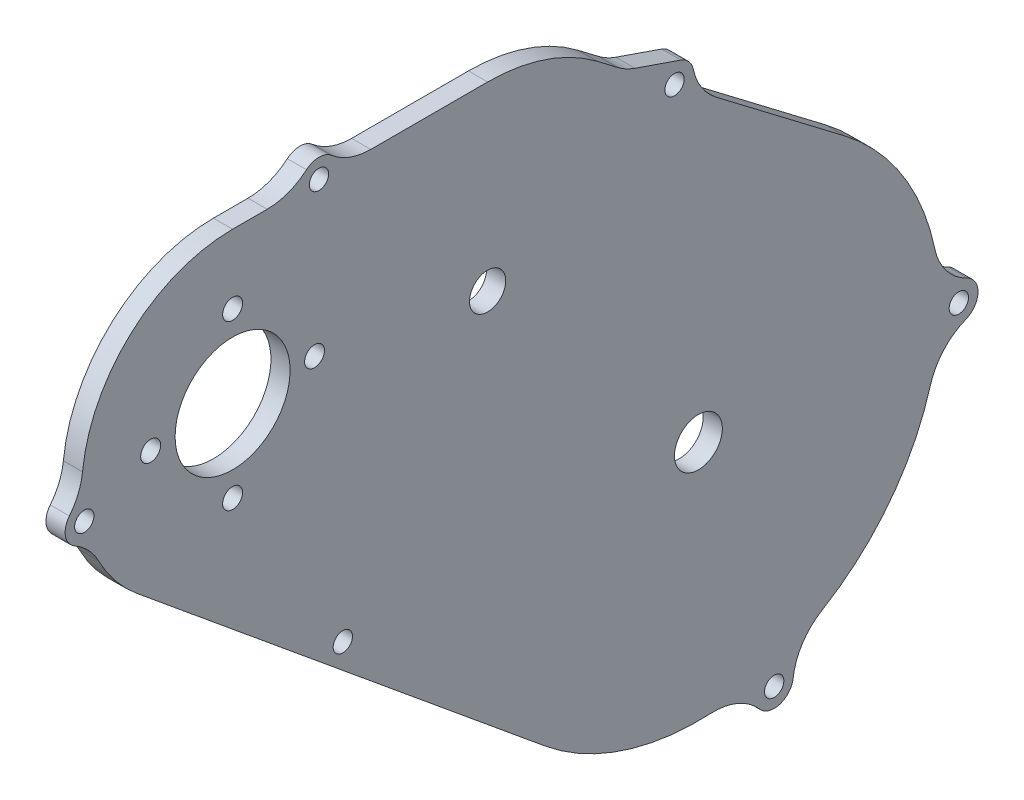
from build123d import *
from build123d.topology import SkipClean

# Parameters (mm, degrees)
SKETCH1_R           = 7.5
SKETCH1_R_2         = 6
SKETCH1_R_3         = 7.9375
BOSS_EXTRUDE1_DEPTH = 6.35
SKETCH2_R           = 3.2
BOSS_EXTRUDE2_DEPTH = 6.35
SKETCH2_4_R         = 3.2
CUT_EXTRUDE1_DEPTH  = 6.35
FILLET1_R           = 20
SKETCH4_R           = 3.302
SKETCH4_R_2         = 19.05
CUT_EXTRUDE2_DEPTH  = 431.293007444


with BuildPart() as part:
    # Sketch1 → Boss-Extrude1 (new body)
    with BuildSketch(Plane(origin=(0, 0, 0), x_dir=(0, 0, -1), z_dir=(1, 0, 0))):
        with BuildLine():
            Line((163.770527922, 94.777939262), (28.507823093, 206.208817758))
            ThreePointArc((28.507823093, 206.208817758), (13.238211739, 261.688470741), (60.299656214, 294.8))
            Line((60.299656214, 294.8), (144.8, 294.8))
            ThreePointArc((144.8, 294.8), (163.972250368, 291.654417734), (181.13423771, 282.547493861))
            Line((181.13423771, 282.547493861), (263.083111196, 220.187155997))
            ThreePointArc((263.083111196, 220.187155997), (277.353755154, 106.858285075), (163.770527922, 94.777939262))
        make_face()
        with Locations((60.299656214, 244.8)):
            Circle(SKETCH1_R, mode=Mode.SUBTRACT)
        with Locations((144.8, 234.8)):
            Circle(SKETCH1_R_2, mode=Mode.SUBTRACT)
        with Locations((214.637460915, 156.523830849)):
            Circle(SKETCH1_R_3, mode=Mode.SUBTRACT)
    extrude(amount=BOSS_EXTRUDE1_DEPTH)

    # Sketch2 → Boss-Extrude2 (add)
    # profile 1 of 5: a face of its own
    with BuildSketch(Plane.ZY):
        with BuildLine():
            ThreePointArc((-294.068401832, 146.998830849), (-294.574031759, 153.338765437), (-294.57443218, 159.698830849))
            Line((-294.57443218, 159.698830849), (-300.929070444, 159.698830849))
            ThreePointArc((-300.929070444, 159.698830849), (-307.279070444, 153.348830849), (-300.929070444, 146.998830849))
            Line((-300.929070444, 146.998830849), (-294.068401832, 146.998830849))
        make_face()
        with Locations((-300.929070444, 153.348830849)):
            Circle(SKETCH2_R, mode=Mode.SUBTRACT)
    # profile 2 of 5: a face of its own
    with BuildSketch(Plane.ZY):
        with BuildLine():
            ThreePointArc((-232.201821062, 78.475811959), (-237.893753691, 79.978779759), (-243.459749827, 81.896251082))
            Line((-243.459749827, 81.896251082), (-245.663286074, 76.190785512))
            ThreePointArc((-245.663286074, 76.190785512), (-241.585690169, 67.827252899), (-233.544660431, 72.508845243))
            Line((-233.544660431, 72.508845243), (-232.201821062, 78.475811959))
        make_face()
        with Locations((-239.73972193, 73.903016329)):
            Circle(SKETCH2_R, mode=Mode.SUBTRACT)
    # profile 3 of 5: a face of its own
    with BuildSketch(Plane.ZY):
        with BuildLine():
            Line((-212.944199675, 261.808035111), (-212.332558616, 258.806620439))
            Line((-212.332558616, 258.806620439), (-209.268614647, 261.1381788))
            ThreePointArc((-209.268614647, 261.1381788), (-208.659907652, 265.622537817), (-204.175548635, 265.013830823))
            Line((-204.175548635, 265.013830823), (-190.559908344, 275.37487537))
            Line((-190.559908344, 275.37487537), (-208.794705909, 269.078231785))
            ThreePointArc((-208.794705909, 269.078231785), (-212.23702746, 266.223682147), (-212.944199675, 261.808035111))
        make_face()
    # profile 4 of 5: a face of its own
    with BuildSketch(Plane.ZY):
        with BuildLine():
            ThreePointArc((-92.118800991, 294.8), (-88.918800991, 298), (-85.718800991, 294.8))
            Line((-85.718800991, 294.8), (-82.568800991, 294.8))
            ThreePointArc((-82.568800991, 294.8), (-88.918800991, 301.15), (-95.268800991, 294.8))
            Line((-95.268800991, 294.8), (-92.118800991, 294.8))
        make_face()
    # profile 5 of 5: a face of its own
    with BuildSketch(Plane.ZY):
        with BuildLine():
            ThreePointArc((-12.728672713, 229.405146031), (-4.920512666, 234.384964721), (-10.38609944, 241.861148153))
            ThreePointArc((-10.38609944, 241.861148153), (-10.503587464, 240.288732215), (-10.67059858, 238.720802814))
            ThreePointArc((-10.67059858, 238.720802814), (-8.731125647, 237.640730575), (-7.961108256, 235.558619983))
            ThreePointArc((-7.961108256, 235.558619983), (-9.157823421, 233.063254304), (-11.852889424, 232.434289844))
            ThreePointArc((-11.852889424, 232.434289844), (-12.266896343, 230.912812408), (-12.728672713, 229.405146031))
        make_face()
    extrude(amount=-BOSS_EXTRUDE2_DEPTH)

    # Sketch2_4 → Cut-Extrude1 (cut)
    with SkipClean():  # the faces are left unmerged after this step: merging them gives an invalid solid
        with BuildSketch(Plane.ZY):
            with Locations((-96.824907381, 158.155733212)):
                Circle(SKETCH2_4_R)
            with BuildLine():
                ThreePointArc((-10.67059858, 238.720802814), (-11.161108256, 235.558619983), (-11.852889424, 232.434289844))
                ThreePointArc((-11.852889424, 232.434289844), (-9.157823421, 233.063254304), (-7.961108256, 235.558619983))
                ThreePointArc((-7.961108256, 235.558619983), (-8.731125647, 237.640730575), (-10.67059858, 238.720802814))
            make_face()
            with BuildLine():
                ThreePointArc((-10.67059858, 238.720802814), (-14.305975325, 236.150068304), (-11.852889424, 232.434289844))
                ThreePointArc((-11.852889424, 232.434289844), (-11.161108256, 235.558619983), (-10.67059858, 238.720802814))
            make_face()
            with BuildLine():
                ThreePointArc((-92.118800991, 294.8), (-88.918800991, 291.6), (-85.718800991, 294.8))
                Line((-85.718800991, 294.8), (-92.118800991, 294.8))
            make_face()
            with BuildLine():
                Line((-92.118800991, 294.8), (-85.718800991, 294.8))
                ThreePointArc((-85.718800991, 294.8), (-88.918800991, 298), (-92.118800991, 294.8))
            make_face()
            with BuildLine():
                ThreePointArc((-204.175548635, 265.013830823), (-208.659907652, 265.622537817), (-209.268614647, 261.1381788))
                Line((-209.268614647, 261.1381788), (-204.175548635, 265.013830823))
            make_face()
            with BuildLine():
                Line((-204.175548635, 265.013830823), (-209.268614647, 261.1381788))
                ThreePointArc((-209.268614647, 261.1381788), (-205.699561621, 260.043769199), (-203.522081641, 263.076004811))
                ThreePointArc((-203.522081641, 263.076004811), (-203.689846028, 264.098524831), (-204.175548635, 265.013830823))
            make_face()
        extrude(amount=-CUT_EXTRUDE1_DEPTH, mode=Mode.SUBTRACT)

    # Fillet1
    fillet1_edges = [part.edges().sort_by_distance(p)[0] for p in [
        (3.175, 294.8, -82.568800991),
        (3.175, 294.8, -95.268800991),
        (3.175, 229.405146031, -12.728672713),
        (3.175, 241.861148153, -10.38609944),
        (3.175, 78.475811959, -232.201821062),
        (3.175, 81.896251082, -243.459749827),
        (3.175, 159.698830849, -294.57443218),
        (3.175, 146.998830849, -294.068401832),
        (3.175, 258.806620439, -212.332558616),
        (3.175, 275.37487537, -190.559908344),
    ]]
    fillet(fillet1_edges, radius=FILLET1_R)

    # Sketch4 → Cut-Extrude2 (cut, through all)
    with SkipClean():  # the faces are left unmerged after this step: merging them gives an invalid solid
        with BuildSketch(Plane.ZY):
            with Locations((-33.149656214, 244.8)):
                Circle(SKETCH4_R)
            with Locations((-60.299656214, 244.8)):
                Circle(SKETCH4_R_2)
            with Locations((-60.299656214, 217.65)):
                Circle(SKETCH4_R)
            with Locations((-87.449656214, 244.8)):
                Circle(SKETCH4_R)
            with Locations((-60.299656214, 271.95)):
                Circle(SKETCH4_R)
        extrude(amount=-CUT_EXTRUDE2_DEPTH, mode=Mode.SUBTRACT)


solid = part.part
